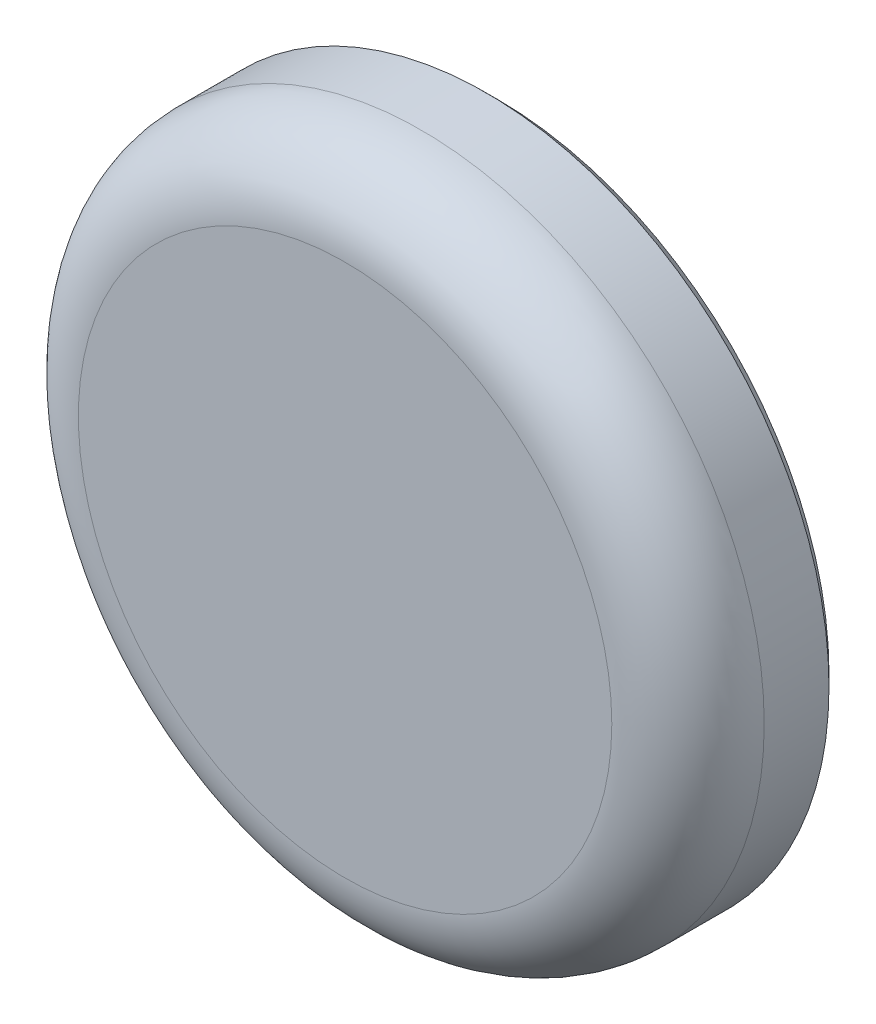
from build123d import *

# Parameters (mm, degrees)
SKETCH_1_R      = 4.5
EXTRUDE_1_DEPTH = 2
FILLET_1_R      = 1
CHAMFER_1_SIZE  = 0.15


with BuildPart() as part:
    # Sketch 1 → Extrude 1 (new body)
    with BuildSketch(Plane.XY):
        Circle(SKETCH_1_R)
    extrude(amount=EXTRUDE_1_DEPTH)

    # Fillet 1
    fillet_1_edges = [part.edges().sort_by_distance(p)[0] for p in [
        (-4.5, 0, 2),
    ]]
    fillet(fillet_1_edges, radius=FILLET_1_R)

    # Chamfer 1
    chamfer_1_edges = [part.edges().sort_by_distance(p)[0] for p in [
        (-4.5, 0, 0),
    ]]
    chamfer(chamfer_1_edges, length=CHAMFER_1_SIZE)


solid = part.part
